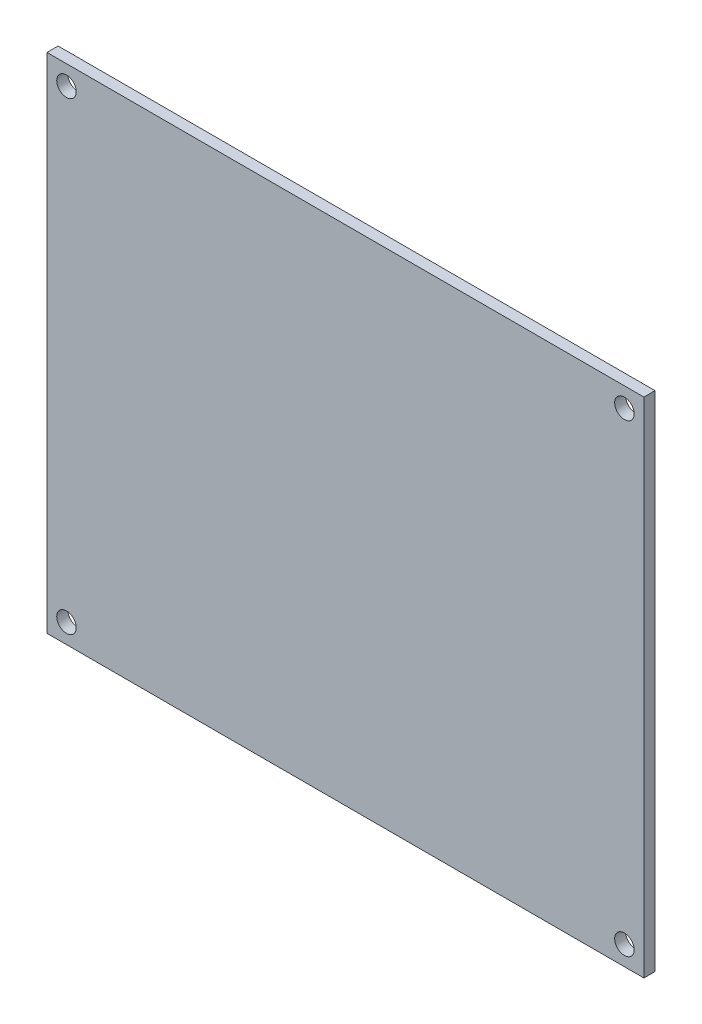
ISO-10303-21;
HEADER;
FILE_DESCRIPTION(('STEP AP214'),'2;1');
FILE_NAME('part.step','',(''),(''),'','','');
FILE_SCHEMA(('AUTOMOTIVE_DESIGN { 1 0 10303 214 1 1 1 1 }'));
ENDSEC;
DATA;
#1=APPLICATION_CONTEXT('core data for automotive mechanical design processes');
#2=APPLICATION_PROTOCOL_DEFINITION('international standard','automotive_design',2000,#1);
#3=PRODUCT_CONTEXT('',#1,'mechanical');
#4=PRODUCT('Part','Part','',(#3));
#5=PRODUCT_RELATED_PRODUCT_CATEGORY('part','',(#4));
#6=PRODUCT_DEFINITION_FORMATION('','',#4);
#7=PRODUCT_DEFINITION_CONTEXT('part definition',#1,'design');
#8=PRODUCT_DEFINITION('design','',#6,#7);
#9=PRODUCT_DEFINITION_SHAPE('','',#8);
#10=(LENGTH_UNIT() NAMED_UNIT(*) SI_UNIT(.MILLI.,.METRE.));
#11=(NAMED_UNIT(*) PLANE_ANGLE_UNIT() SI_UNIT($,.RADIAN.));
#12=(NAMED_UNIT(*) SI_UNIT($,.STERADIAN.) SOLID_ANGLE_UNIT());
#13=UNCERTAINTY_MEASURE_WITH_UNIT(LENGTH_MEASURE(1.E-05),#10,'distance_accuracy_value','');
#14=(GEOMETRIC_REPRESENTATION_CONTEXT(3) GLOBAL_UNCERTAINTY_ASSIGNED_CONTEXT((#13)) GLOBAL_UNIT_ASSIGNED_CONTEXT((#10,
#11,#12)) REPRESENTATION_CONTEXT('',''));
#15=CARTESIAN_POINT('',(0.,0.,0.));
#16=DIRECTION('',(0.,0.,1.));
#17=DIRECTION('',(1.,0.,0.));
#18=AXIS2_PLACEMENT_3D('',#15,#16,#17);
#19=CARTESIAN_POINT('',(0.,-82.5999999,1.82611268));
#20=DIRECTION('',(0.,0.,-1.));
#21=DIRECTION('',(-1.,0.,0.));
#22=AXIS2_PLACEMENT_3D('',#19,#20,#21);
#23=PLANE('',#22);
#24=CARTESIAN_POINT('',(94.8000009,-3.20000376,1.82611268));
#25=DIRECTION('',(0.,0.,-1.));
#26=DIRECTION('',(-1.,0.,0.));
#27=AXIS2_PLACEMENT_3D('',#24,#25,#26);
#28=CIRCLE('',#27,1.59999934);
#29=CARTESIAN_POINT('',(93.20000156,-3.20000376,1.82611268));
#30=VERTEX_POINT('',#29);
#31=EDGE_CURVE('E91',#30,#30,#28,.T.);
#32=ORIENTED_EDGE('',*,*,#31,.T.);
#33=EDGE_LOOP('',(#32));
#34=FACE_BOUND('',#33,.T.);
#35=CARTESIAN_POINT('',(94.8000009,-79.39999868,1.82611268));
#36=DIRECTION('',(0.,0.,-1.));
#37=DIRECTION('',(-1.,0.,0.));
#38=AXIS2_PLACEMENT_3D('',#35,#36,#37);
#39=CIRCLE('',#38,1.59999934);
#40=CARTESIAN_POINT('',(93.20000156,-79.39999868,1.82611268));
#41=VERTEX_POINT('',#40);
#42=EDGE_CURVE('E95',#41,#41,#39,.T.);
#43=ORIENTED_EDGE('',*,*,#42,.T.);
#44=EDGE_LOOP('',(#43));
#45=FACE_BOUND('',#44,.T.);
#46=CARTESIAN_POINT('',(3.20000122,-3.20000376,1.82611268));
#47=DIRECTION('',(0.,0.,-1.));
#48=DIRECTION('',(-1.,0.,0.));
#49=AXIS2_PLACEMENT_3D('',#46,#47,#48);
#50=CIRCLE('',#49,1.59999934);
#51=CARTESIAN_POINT('',(1.60000188,-3.20000376,1.82611268));
#52=VERTEX_POINT('',#51);
#53=EDGE_CURVE('E97',#52,#52,#50,.T.);
#54=ORIENTED_EDGE('',*,*,#53,.T.);
#55=EDGE_LOOP('',(#54));
#56=FACE_BOUND('',#55,.T.);
#57=CARTESIAN_POINT('',(3.20000122,-79.39999868,1.82611268));
#58=DIRECTION('',(0.,0.,-1.));
#59=DIRECTION('',(-1.,0.,0.));
#60=AXIS2_PLACEMENT_3D('',#57,#58,#59);
#61=CIRCLE('',#60,1.59999934);
#62=CARTESIAN_POINT('',(1.60000188,-79.39999868,1.82611268));
#63=VERTEX_POINT('',#62);
#64=EDGE_CURVE('E20',#63,#63,#61,.T.);
#65=ORIENTED_EDGE('',*,*,#64,.T.);
#66=EDGE_LOOP('',(#65));
#67=FACE_BOUND('',#66,.T.);
#68=DIRECTION('',(0.,1.,0.));
#69=VECTOR('',#68,1.);
#70=CARTESIAN_POINT('',(97.99999958,-82.5999999,1.82611268));
#71=LINE('',#70,#69);
#72=CARTESIAN_POINT('',(97.99999958,-82.5999999,1.82611268));
#73=VERTEX_POINT('',#72);
#74=CARTESIAN_POINT('',(97.99999958,0.,1.82611268));
#75=VERTEX_POINT('',#74);
#76=EDGE_CURVE('E55',#73,#75,#71,.T.);
#77=ORIENTED_EDGE('',*,*,#76,.T.);
#78=DIRECTION('',(1.,0.,0.));
#79=VECTOR('',#78,1.);
#80=CARTESIAN_POINT('',(97.99999958,0.,1.82611268));
#81=LINE('',#80,#79);
#82=CARTESIAN_POINT('',(0.,0.,1.82611268));
#83=VERTEX_POINT('',#82);
#84=EDGE_CURVE('E57',#75,#83,#81,.F.);
#85=ORIENTED_EDGE('',*,*,#84,.T.);
#86=DIRECTION('',(0.,1.,0.));
#87=VECTOR('',#86,1.);
#88=CARTESIAN_POINT('',(0.,0.,1.82611268));
#89=LINE('',#88,#87);
#90=CARTESIAN_POINT('',(0.,-82.5999999,1.82611268));
#91=VERTEX_POINT('',#90);
#92=EDGE_CURVE('E59',#83,#91,#89,.F.);
#93=ORIENTED_EDGE('',*,*,#92,.T.);
#94=DIRECTION('',(1.,0.,0.));
#95=VECTOR('',#94,1.);
#96=CARTESIAN_POINT('',(0.,-82.5999999,1.82611268));
#97=LINE('',#96,#95);
#98=EDGE_CURVE('E104',#91,#73,#97,.T.);
#99=ORIENTED_EDGE('',*,*,#98,.T.);
#100=EDGE_LOOP('',(#77,#85,#93,#99));
#101=FACE_BOUND('',#100,.T.);
#102=ADVANCED_FACE('F17',(#34,#45,#56,#67,#101),#23,.F.);
#103=CARTESIAN_POINT('',(0.,0.,0.));
#104=DIRECTION('',(1.,0.,0.));
#105=DIRECTION('',(0.,0.,-1.));
#106=AXIS2_PLACEMENT_3D('',#103,#104,#105);
#107=PLANE('',#106);
#108=DIRECTION('',(0.,0.,1.));
#109=VECTOR('',#108,1.);
#110=CARTESIAN_POINT('',(0.,-82.5999999,0.));
#111=LINE('',#110,#109);
#112=CARTESIAN_POINT('',(0.,-82.5999999,0.));
#113=VERTEX_POINT('',#112);
#114=EDGE_CURVE('E70',#113,#91,#111,.T.);
#115=ORIENTED_EDGE('',*,*,#114,.T.);
#116=ORIENTED_EDGE('',*,*,#92,.F.);
#117=DIRECTION('',(0.,0.,-1.));
#118=VECTOR('',#117,1.);
#119=CARTESIAN_POINT('',(0.,0.,0.));
#120=LINE('',#119,#118);
#121=CARTESIAN_POINT('',(0.,0.,0.));
#122=VERTEX_POINT('',#121);
#123=EDGE_CURVE('E64',#83,#122,#120,.T.);
#124=ORIENTED_EDGE('',*,*,#123,.T.);
#125=DIRECTION('',(0.,1.,0.));
#126=VECTOR('',#125,1.);
#127=CARTESIAN_POINT('',(0.,-82.5999999,0.));
#128=LINE('',#127,#126);
#129=EDGE_CURVE('E94',#113,#122,#128,.T.);
#130=ORIENTED_EDGE('',*,*,#129,.F.);
#131=EDGE_LOOP('',(#115,#116,#124,#130));
#132=FACE_BOUND('',#131,.T.);
#133=ADVANCED_FACE('F67',(#132),#107,.F.);
#134=CARTESIAN_POINT('',(97.99999958,0.,0.));
#135=DIRECTION('',(0.,-1.,0.));
#136=DIRECTION('',(0.,0.,-1.));
#137=AXIS2_PLACEMENT_3D('',#134,#135,#136);
#138=PLANE('',#137);
#139=ORIENTED_EDGE('',*,*,#123,.F.);
#140=ORIENTED_EDGE('',*,*,#84,.F.);
#141=DIRECTION('',(0.,0.,1.));
#142=VECTOR('',#141,1.);
#143=CARTESIAN_POINT('',(97.99999958,0.,0.));
#144=LINE('',#143,#142);
#145=CARTESIAN_POINT('',(97.99999958,0.,0.));
#146=VERTEX_POINT('',#145);
#147=EDGE_CURVE('E78',#75,#146,#144,.F.);
#148=ORIENTED_EDGE('',*,*,#147,.T.);
#149=DIRECTION('',(-1.,0.,0.));
#150=VECTOR('',#149,1.);
#151=CARTESIAN_POINT('',(0.,0.,0.));
#152=LINE('',#151,#150);
#153=EDGE_CURVE('E75',#122,#146,#152,.F.);
#154=ORIENTED_EDGE('',*,*,#153,.F.);
#155=EDGE_LOOP('',(#139,#140,#148,#154));
#156=FACE_BOUND('',#155,.T.);
#157=ADVANCED_FACE('F73',(#156),#138,.F.);
#158=CARTESIAN_POINT('',(97.99999958,-82.5999999,0.));
#159=DIRECTION('',(-1.,0.,0.));
#160=DIRECTION('',(0.,0.,1.));
#161=AXIS2_PLACEMENT_3D('',#158,#159,#160);
#162=PLANE('',#161);
#163=ORIENTED_EDGE('',*,*,#147,.F.);
#164=ORIENTED_EDGE('',*,*,#76,.F.);
#165=DIRECTION('',(0.,0.,1.));
#166=VECTOR('',#165,1.);
#167=CARTESIAN_POINT('',(97.99999958,-82.5999999,0.));
#168=LINE('',#167,#166);
#169=CARTESIAN_POINT('',(97.99999958,-82.5999999,0.));
#170=VERTEX_POINT('',#169);
#171=EDGE_CURVE('E35',#73,#170,#168,.F.);
#172=ORIENTED_EDGE('',*,*,#171,.T.);
#173=DIRECTION('',(0.,1.,0.));
#174=VECTOR('',#173,1.);
#175=CARTESIAN_POINT('',(97.99999958,-82.5999999,0.));
#176=LINE('',#175,#174);
#177=EDGE_CURVE('E111',#146,#170,#176,.F.);
#178=ORIENTED_EDGE('',*,*,#177,.F.);
#179=EDGE_LOOP('',(#163,#164,#172,#178));
#180=FACE_BOUND('',#179,.T.);
#181=ADVANCED_FACE('F112',(#180),#162,.F.);
#182=CARTESIAN_POINT('',(0.,-82.5999999,0.));
#183=DIRECTION('',(0.,1.,0.));
#184=DIRECTION('',(0.,0.,1.));
#185=AXIS2_PLACEMENT_3D('',#182,#183,#184);
#186=PLANE('',#185);
#187=ORIENTED_EDGE('',*,*,#171,.F.);
#188=ORIENTED_EDGE('',*,*,#98,.F.);
#189=ORIENTED_EDGE('',*,*,#114,.F.);
#190=DIRECTION('',(-1.,0.,0.));
#191=VECTOR('',#190,1.);
#192=CARTESIAN_POINT('',(0.,-82.5999999,0.));
#193=LINE('',#192,#191);
#194=EDGE_CURVE('E90',#170,#113,#193,.T.);
#195=ORIENTED_EDGE('',*,*,#194,.F.);
#196=EDGE_LOOP('',(#187,#188,#189,#195));
#197=FACE_BOUND('',#196,.T.);
#198=ADVANCED_FACE('F119',(#197),#186,.F.);
#199=CARTESIAN_POINT('',(3.20000122,-79.39999868,0.));
#200=DIRECTION('',(0.,0.,-1.));
#201=DIRECTION('',(-1.,0.,0.));
#202=AXIS2_PLACEMENT_3D('',#199,#200,#201);
#203=CYLINDRICAL_SURFACE('',#202,1.59999934);
#204=ORIENTED_EDGE('',*,*,#64,.F.);
#205=EDGE_LOOP('',(#204));
#206=FACE_BOUND('',#205,.T.);
#207=CARTESIAN_POINT('',(3.20000122,-79.39999868,0.));
#208=DIRECTION('',(0.,0.,-1.));
#209=DIRECTION('',(-1.,0.,0.));
#210=AXIS2_PLACEMENT_3D('',#207,#208,#209);
#211=CIRCLE('',#210,1.59999934);
#212=CARTESIAN_POINT('',(1.60000188,-79.39999868,0.));
#213=VERTEX_POINT('',#212);
#214=EDGE_CURVE('E87',#213,#213,#211,.F.);
#215=ORIENTED_EDGE('',*,*,#214,.F.);
#216=EDGE_LOOP('',(#215));
#217=FACE_BOUND('',#216,.T.);
#218=ADVANCED_FACE('F121',(#206,#217),#203,.F.);
#219=CARTESIAN_POINT('',(3.20000122,-3.20000376,0.));
#220=DIRECTION('',(0.,0.,-1.));
#221=DIRECTION('',(-1.,0.,0.));
#222=AXIS2_PLACEMENT_3D('',#219,#220,#221);
#223=CYLINDRICAL_SURFACE('',#222,1.59999934);
#224=ORIENTED_EDGE('',*,*,#53,.F.);
#225=EDGE_LOOP('',(#224));
#226=FACE_BOUND('',#225,.T.);
#227=CARTESIAN_POINT('',(3.20000122,-3.20000376,0.));
#228=DIRECTION('',(0.,0.,-1.));
#229=DIRECTION('',(-1.,0.,0.));
#230=AXIS2_PLACEMENT_3D('',#227,#228,#229);
#231=CIRCLE('',#230,1.59999934);
#232=CARTESIAN_POINT('',(1.60000188,-3.20000376,0.));
#233=VERTEX_POINT('',#232);
#234=EDGE_CURVE('E84',#233,#233,#231,.F.);
#235=ORIENTED_EDGE('',*,*,#234,.F.);
#236=EDGE_LOOP('',(#235));
#237=FACE_BOUND('',#236,.T.);
#238=ADVANCED_FACE('F128',(#226,#237),#223,.F.);
#239=CARTESIAN_POINT('',(94.8000009,-79.39999868,0.));
#240=DIRECTION('',(0.,0.,-1.));
#241=DIRECTION('',(-1.,0.,0.));
#242=AXIS2_PLACEMENT_3D('',#239,#240,#241);
#243=CYLINDRICAL_SURFACE('',#242,1.59999934);
#244=ORIENTED_EDGE('',*,*,#42,.F.);
#245=EDGE_LOOP('',(#244));
#246=FACE_BOUND('',#245,.T.);
#247=CARTESIAN_POINT('',(94.8000009,-79.39999868,0.));
#248=DIRECTION('',(0.,0.,-1.));
#249=DIRECTION('',(-1.,0.,0.));
#250=AXIS2_PLACEMENT_3D('',#247,#248,#249);
#251=CIRCLE('',#250,1.59999934);
#252=CARTESIAN_POINT('',(93.20000156,-79.39999868,0.));
#253=VERTEX_POINT('',#252);
#254=EDGE_CURVE('E26',#253,#253,#251,.F.);
#255=ORIENTED_EDGE('',*,*,#254,.F.);
#256=EDGE_LOOP('',(#255));
#257=FACE_BOUND('',#256,.T.);
#258=ADVANCED_FACE('F139',(#246,#257),#243,.F.);
#259=CARTESIAN_POINT('',(94.8000009,-3.20000376,0.));
#260=DIRECTION('',(0.,0.,-1.));
#261=DIRECTION('',(-1.,0.,0.));
#262=AXIS2_PLACEMENT_3D('',#259,#260,#261);
#263=CYLINDRICAL_SURFACE('',#262,1.59999934);
#264=ORIENTED_EDGE('',*,*,#31,.F.);
#265=EDGE_LOOP('',(#264));
#266=FACE_BOUND('',#265,.T.);
#267=CARTESIAN_POINT('',(94.8000009,-3.20000376,0.));
#268=DIRECTION('',(0.,0.,-1.));
#269=DIRECTION('',(-1.,0.,0.));
#270=AXIS2_PLACEMENT_3D('',#267,#268,#269);
#271=CIRCLE('',#270,1.59999934);
#272=CARTESIAN_POINT('',(93.20000156,-3.20000376,0.));
#273=VERTEX_POINT('',#272);
#274=EDGE_CURVE('E11',#273,#273,#271,.F.);
#275=ORIENTED_EDGE('',*,*,#274,.F.);
#276=EDGE_LOOP('',(#275));
#277=FACE_BOUND('',#276,.T.);
#278=ADVANCED_FACE('F133',(#266,#277),#263,.F.);
#279=CARTESIAN_POINT('',(0.,-82.5999999,0.));
#280=DIRECTION('',(0.,0.,-1.));
#281=DIRECTION('',(-1.,0.,0.));
#282=AXIS2_PLACEMENT_3D('',#279,#280,#281);
#283=PLANE('',#282);
#284=ORIENTED_EDGE('',*,*,#274,.T.);
#285=EDGE_LOOP('',(#284));
#286=FACE_BOUND('',#285,.T.);
#287=ORIENTED_EDGE('',*,*,#254,.T.);
#288=EDGE_LOOP('',(#287));
#289=FACE_BOUND('',#288,.T.);
#290=ORIENTED_EDGE('',*,*,#234,.T.);
#291=EDGE_LOOP('',(#290));
#292=FACE_BOUND('',#291,.T.);
#293=ORIENTED_EDGE('',*,*,#214,.T.);
#294=EDGE_LOOP('',(#293));
#295=FACE_BOUND('',#294,.T.);
#296=ORIENTED_EDGE('',*,*,#177,.T.);
#297=ORIENTED_EDGE('',*,*,#194,.T.);
#298=ORIENTED_EDGE('',*,*,#129,.T.);
#299=ORIENTED_EDGE('',*,*,#153,.T.);
#300=EDGE_LOOP('',(#296,#297,#298,#299));
#301=FACE_BOUND('',#300,.T.);
#302=ADVANCED_FACE('F116',(#286,#289,#292,#295,#301),#283,.T.);
#303=CLOSED_SHELL('',(#102,#133,#157,#181,#198,#218,#238,#258,#278,#302));
#304=MANIFOLD_SOLID_BREP('B1',#303);
#305=ADVANCED_BREP_SHAPE_REPRESENTATION('',(#18,#304),#14);
#306=SHAPE_DEFINITION_REPRESENTATION(#9,#305);
ENDSEC;
END-ISO-10303-21;
